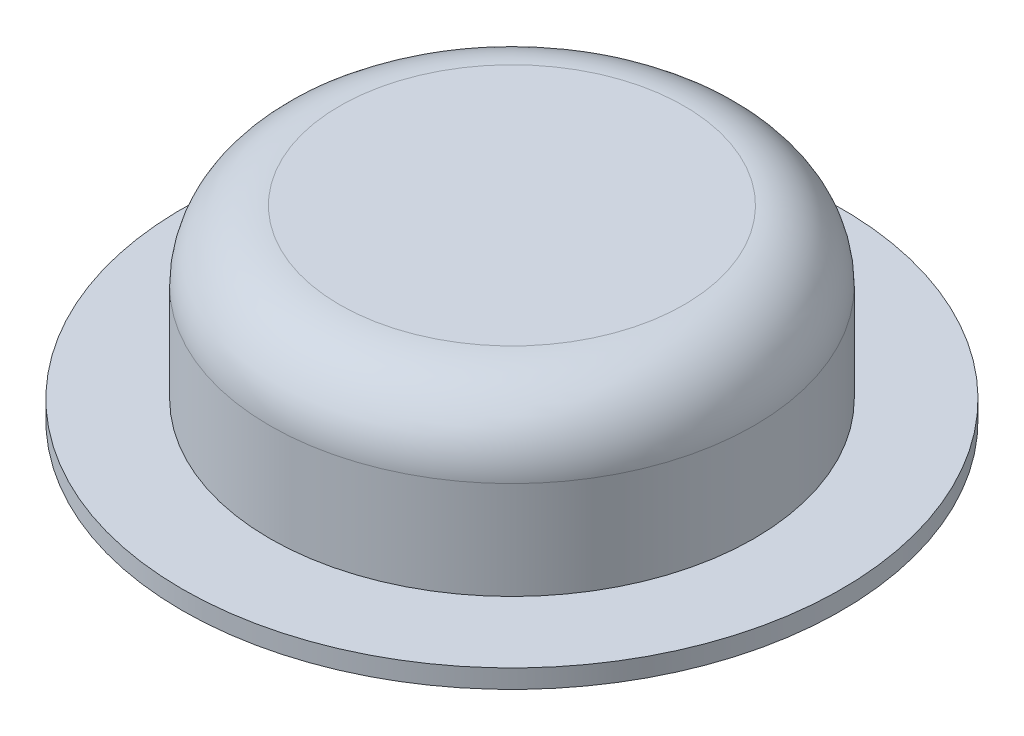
from build123d import *

# Parameters (mm, degrees)
SKETCH1_R           = 44.958
BOSS_EXTRUDE1_DEPTH = 2.54
SKETCH2_R           = 33.02
BOSS_EXTRUDE2_DEPTH = 22.86
FILLET1_R           = 9.525


with BuildPart() as part:
    # Sketch1 → Boss-Extrude1 (new body)
    with BuildSketch(Plane(origin=(0, 0, 0), x_dir=(1, 0, 0), z_dir=(0, 1, 0))):
        with Locations(Location((0, 0, 0), (0, 0, 270))):
            Circle(SKETCH1_R)
    extrude(amount=BOSS_EXTRUDE1_DEPTH)

    # Sketch2 → Boss-Extrude2 (add)
    with BuildSketch(Plane(origin=(0, 2.54, 0), x_dir=(1, 0, 0), z_dir=(0, 1, 0))):
        with Locations(Location((0, 0, 0), (0, 0, 270))):
            Circle(SKETCH2_R)
    extrude(amount=BOSS_EXTRUDE2_DEPTH)

    # Fillet1
    fillet1_edges = [part.edges().sort_by_distance(p)[0] for p in [
        (0, 25.4, -33.02),
    ]]
    fillet(fillet1_edges, radius=FILLET1_R)


solid = part.part
